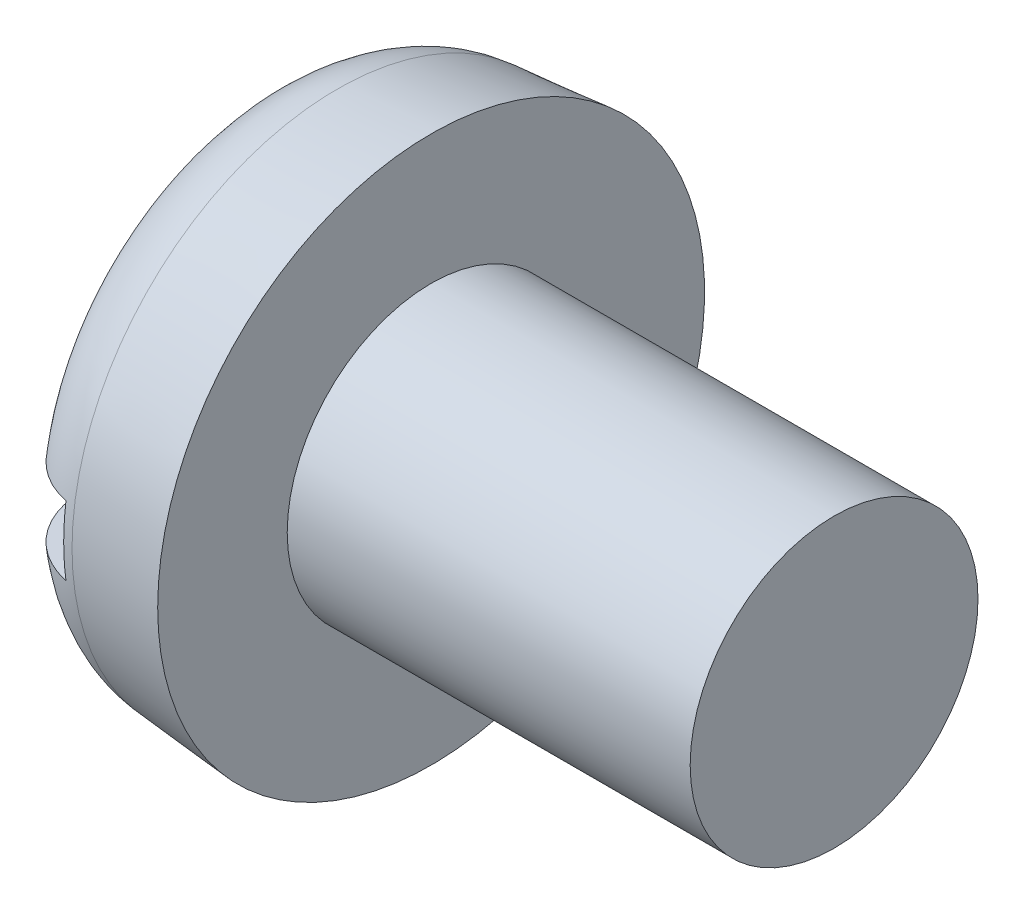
ISO-10303-21;
HEADER;
FILE_DESCRIPTION(('STEP AP214'),'2;1');
FILE_NAME('part.step','',(''),(''),'','','');
FILE_SCHEMA(('AUTOMOTIVE_DESIGN { 1 0 10303 214 1 1 1 1 }'));
ENDSEC;
DATA;
#1=APPLICATION_CONTEXT('core data for automotive mechanical design processes');
#2=APPLICATION_PROTOCOL_DEFINITION('international standard','automotive_design',2000,#1);
#3=PRODUCT_CONTEXT('',#1,'mechanical');
#4=PRODUCT('Part','Part','',(#3));
#5=PRODUCT_RELATED_PRODUCT_CATEGORY('part','',(#4));
#6=PRODUCT_DEFINITION_FORMATION('','',#4);
#7=PRODUCT_DEFINITION_CONTEXT('part definition',#1,'design');
#8=PRODUCT_DEFINITION('design','',#6,#7);
#9=PRODUCT_DEFINITION_SHAPE('','',#8);
#10=(LENGTH_UNIT() NAMED_UNIT(*) SI_UNIT(.MILLI.,.METRE.));
#11=(NAMED_UNIT(*) PLANE_ANGLE_UNIT() SI_UNIT($,.RADIAN.));
#12=(NAMED_UNIT(*) SI_UNIT($,.STERADIAN.) SOLID_ANGLE_UNIT());
#13=UNCERTAINTY_MEASURE_WITH_UNIT(LENGTH_MEASURE(1.E-05),#10,'distance_accuracy_value','');
#14=(GEOMETRIC_REPRESENTATION_CONTEXT(3) GLOBAL_UNCERTAINTY_ASSIGNED_CONTEXT((#13)) GLOBAL_UNIT_ASSIGNED_CONTEXT((#10,
#11,#12)) REPRESENTATION_CONTEXT('',''));
#15=CARTESIAN_POINT('',(0.,0.,0.));
#16=DIRECTION('',(0.,0.,1.));
#17=DIRECTION('',(1.,0.,0.));
#18=AXIS2_PLACEMENT_3D('',#15,#16,#17);
#19=CARTESIAN_POINT('',(0.,0.,0.));
#20=DIRECTION('',(-1.,0.,0.));
#21=DIRECTION('',(0.,0.,1.));
#22=AXIS2_PLACEMENT_3D('',#19,#20,#21);
#23=PLANE('',#22);
#24=DIRECTION('',(0.,0.,-1.));
#25=VECTOR('',#24,1.);
#26=CARTESIAN_POINT('',(0.,0.599999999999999,4.75));
#27=LINE('',#26,#25);
#28=CARTESIAN_POINT('',(0.,0.599999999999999,3.05466870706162));
#29=VERTEX_POINT('',#28);
#30=CARTESIAN_POINT('',(0.,0.599999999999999,-3.05466870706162));
#31=VERTEX_POINT('',#30);
#32=EDGE_CURVE('E86',#29,#31,#27,.T.);
#33=ORIENTED_EDGE('',*,*,#32,.F.);
#34=CARTESIAN_POINT('',(0.,0.,0.));
#35=DIRECTION('',(-1.,0.,0.));
#36=DIRECTION('',(0.,0.,1.));
#37=AXIS2_PLACEMENT_3D('',#34,#35,#36);
#38=CIRCLE('',#37,3.11303724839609);
#39=EDGE_CURVE('E92',#29,#31,#38,.T.);
#40=ORIENTED_EDGE('',*,*,#39,.T.);
#41=EDGE_LOOP('',(#33,#40));
#42=FACE_BOUND('',#41,.T.);
#43=ADVANCED_FACE('F33',(#42),#23,.T.);
#44=CARTESIAN_POINT('',(-25.4,0.,0.));
#45=DIRECTION('',(-1.,0.,0.));
#46=DIRECTION('',(0.,0.,1.));
#47=AXIS2_PLACEMENT_3D('',#44,#45,#46);
#48=CYLINDRICAL_SURFACE('',#47,2.5);
#49=CARTESIAN_POINT('',(10.,0.,0.));
#50=DIRECTION('',(-1.,0.,0.));
#51=DIRECTION('',(0.,0.,1.));
#52=AXIS2_PLACEMENT_3D('',#49,#50,#51);
#53=CIRCLE('',#52,2.5);
#54=CARTESIAN_POINT('',(10.,0.,2.5));
#55=VERTEX_POINT('',#54);
#56=EDGE_CURVE('E93',#55,#55,#53,.T.);
#57=ORIENTED_EDGE('',*,*,#56,.T.);
#58=EDGE_LOOP('',(#57));
#59=FACE_BOUND('',#58,.T.);
#60=CARTESIAN_POINT('',(3.,0.,0.));
#61=DIRECTION('',(-1.,0.,0.));
#62=DIRECTION('',(0.,0.,1.));
#63=AXIS2_PLACEMENT_3D('',#60,#61,#62);
#64=CIRCLE('',#63,2.5);
#65=CARTESIAN_POINT('',(3.,0.,2.5));
#66=VERTEX_POINT('',#65);
#67=EDGE_CURVE('E150',#66,#66,#64,.T.);
#68=ORIENTED_EDGE('',*,*,#67,.F.);
#69=EDGE_LOOP('',(#68));
#70=FACE_BOUND('',#69,.T.);
#71=ADVANCED_FACE('F138',(#59,#70),#48,.T.);
#72=CARTESIAN_POINT('',(10.,2.5,0.));
#73=DIRECTION('',(1.,0.,0.));
#74=DIRECTION('',(0.,0.,-1.));
#75=AXIS2_PLACEMENT_3D('',#72,#73,#74);
#76=PLANE('',#75);
#77=ORIENTED_EDGE('',*,*,#56,.F.);
#78=EDGE_LOOP('',(#77));
#79=FACE_BOUND('',#78,.T.);
#80=ADVANCED_FACE('F136',(#79),#76,.T.);
#81=DIRECTION('',(0.,0.,1.));
#82=VECTOR('',#81,1.);
#83=CARTESIAN_POINT('',(0.,-0.599999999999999,-4.75));
#84=LINE('',#83,#82);
#85=CARTESIAN_POINT('',(0.,-0.599999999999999,-3.05466870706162));
#86=VERTEX_POINT('',#85);
#87=CARTESIAN_POINT('',(0.,-0.6,3.05466870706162));
#88=VERTEX_POINT('',#87);
#89=EDGE_CURVE('E77',#86,#88,#84,.T.);
#90=ORIENTED_EDGE('',*,*,#89,.F.);
#91=EDGE_CURVE('E84',#86,#88,#38,.T.);
#92=ORIENTED_EDGE('',*,*,#91,.T.);
#93=EDGE_LOOP('',(#90,#92));
#94=FACE_BOUND('',#93,.T.);
#95=ADVANCED_FACE('F83',(#94),#23,.T.);
#96=CARTESIAN_POINT('',(0.,0.,0.));
#97=DIRECTION('',(1.,0.,0.));
#98=DIRECTION('',(0.,0.,-1.));
#99=AXIS2_PLACEMENT_3D('',#96,#97,#98);
#100=CONICAL_SURFACE('',#99,4.48753400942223,0.0872664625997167);
#101=CARTESIAN_POINT('',(1.36926638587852,0.,0.));
#102=DIRECTION('',(-1.,0.,0.));
#103=DIRECTION('',(0.,0.,1.));
#104=AXIS2_PLACEMENT_3D('',#101,#102,#103);
#105=CIRCLE('',#104,4.60732929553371);
#106=CARTESIAN_POINT('',(1.36926638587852,0.,4.60732929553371));
#107=VERTEX_POINT('',#106);
#108=EDGE_CURVE('E96',#107,#107,#105,.F.);
#109=ORIENTED_EDGE('',*,*,#108,.T.);
#110=EDGE_LOOP('',(#109));
#111=FACE_BOUND('',#110,.T.);
#112=CARTESIAN_POINT('',(3.,0.,0.));
#113=DIRECTION('',(-1.,0.,0.));
#114=DIRECTION('',(0.,0.,1.));
#115=AXIS2_PLACEMENT_3D('',#112,#113,#114);
#116=CIRCLE('',#115,4.75);
#117=CARTESIAN_POINT('',(3.,0.,4.75));
#118=VERTEX_POINT('',#117);
#119=EDGE_CURVE('E98',#118,#118,#116,.T.);
#120=ORIENTED_EDGE('',*,*,#119,.T.);
#121=EDGE_LOOP('',(#120));
#122=FACE_BOUND('',#121,.T.);
#123=ADVANCED_FACE('F129',(#111,#122),#100,.T.);
#124=CARTESIAN_POINT('',(3.,2.5,0.));
#125=DIRECTION('',(-1.,0.,0.));
#126=DIRECTION('',(0.,0.,1.));
#127=AXIS2_PLACEMENT_3D('',#124,#125,#126);
#128=PLANE('',#127);
#129=ORIENTED_EDGE('',*,*,#119,.F.);
#130=EDGE_LOOP('',(#129));
#131=FACE_BOUND('',#130,.T.);
#132=ORIENTED_EDGE('',*,*,#67,.T.);
#133=EDGE_LOOP('',(#132));
#134=FACE_BOUND('',#133,.T.);
#135=ADVANCED_FACE('F125',(#131,#134),#128,.F.);
#136=CARTESIAN_POINT('',(1.5,0.,0.));
#137=DIRECTION('',(-1.,0.,0.));
#138=DIRECTION('',(0.,0.,1.));
#139=AXIS2_PLACEMENT_3D('',#136,#137,#138);
#140=TOROIDAL_SURFACE('',#139,3.11303724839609,1.5);
#141=CARTESIAN_POINT('',(0.474243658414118,0.599999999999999,-4.16448807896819));
#142=CARTESIAN_POINT('',(0.535197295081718,0.599999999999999,-4.2222007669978));
#143=CARTESIAN_POINT('',(0.601040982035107,0.599999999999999,-4.27483380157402));
#144=CARTESIAN_POINT('',(0.740675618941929,0.599999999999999,-4.36835495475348));
#145=CARTESIAN_POINT('',(0.814475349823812,0.599999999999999,-4.40922990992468));
#146=CARTESIAN_POINT('',(0.967890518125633,0.599999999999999,-4.47797693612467));
#147=CARTESIAN_POINT('',(1.04750461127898,0.599999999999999,-4.50585200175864));
#148=CARTESIAN_POINT('',(1.21027286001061,0.599999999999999,-4.54777716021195));
#149=CARTESIAN_POINT('',(1.29342617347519,0.599999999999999,-4.56183052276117));
#150=CARTESIAN_POINT('',(1.46061786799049,0.599999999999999,-4.57568541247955));
#151=CARTESIAN_POINT('',(1.54465212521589,0.599999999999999,-4.57553672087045));
#152=CARTESIAN_POINT('',(1.71150157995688,0.599999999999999,-4.56111544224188));
#153=CARTESIAN_POINT('',(1.79431675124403,0.599999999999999,-4.546842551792));
#154=CARTESIAN_POINT('',(1.95628107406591,0.599999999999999,-4.50461633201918));
#155=CARTESIAN_POINT('',(2.03543426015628,0.599999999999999,-4.47667847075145));
#156=CARTESIAN_POINT('',(2.18794473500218,0.599999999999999,-4.40794662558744));
#157=CARTESIAN_POINT('',(2.26130200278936,0.599999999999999,-4.36715259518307));
#158=CARTESIAN_POINT('',(2.40037319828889,0.599999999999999,-4.27376142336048));
#159=CARTESIAN_POINT('',(2.46606492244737,0.599999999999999,-4.22113122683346));
#160=CARTESIAN_POINT('',(2.58775416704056,0.599999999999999,-4.10565865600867));
#161=CARTESIAN_POINT('',(2.64375146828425,0.599999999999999,-4.04281605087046));
#162=CARTESIAN_POINT('',(2.7448997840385,0.599999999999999,-3.90824759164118));
#163=CARTESIAN_POINT('',(2.78997229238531,0.599999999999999,-3.83646274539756));
#164=CARTESIAN_POINT('',(2.86758143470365,0.599999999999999,-3.6864129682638));
#165=CARTESIAN_POINT('',(2.90011748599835,0.599999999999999,-3.60814773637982));
#166=CARTESIAN_POINT('',(2.95215516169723,0.599999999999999,-3.44640006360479));
#167=CARTESIAN_POINT('',(2.9715017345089,0.599999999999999,-3.36286776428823));
#168=CARTESIAN_POINT('',(2.99613620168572,0.599999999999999,-3.19375865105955));
#169=CARTESIAN_POINT('',(3.00142305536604,0.599999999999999,-3.10818168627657));
#170=CARTESIAN_POINT('',(2.9978948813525,0.599999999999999,-2.93593785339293));
#171=CARTESIAN_POINT('',(2.98885075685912,0.599999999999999,-2.84927570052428));
#172=CARTESIAN_POINT('',(2.95661294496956,0.599999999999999,-2.67862588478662));
#173=CARTESIAN_POINT('',(2.93341783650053,0.599999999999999,-2.59463849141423));
#174=CARTESIAN_POINT('',(2.87305940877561,0.599999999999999,-2.43009011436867));
#175=CARTESIAN_POINT('',(2.8356478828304,0.599999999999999,-2.3496201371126));
#176=CARTESIAN_POINT('',(2.74798933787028,0.599999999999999,-2.1959917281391));
#177=CARTESIAN_POINT('',(2.69774036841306,0.599999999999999,-2.12283440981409));
#178=CARTESIAN_POINT('',(2.58515210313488,0.599999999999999,-1.98517825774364));
#179=CARTESIAN_POINT('',(2.52268993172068,0.599999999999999,-1.92077976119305));
#180=CARTESIAN_POINT('',(2.3876474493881,0.599999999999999,-1.80360821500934));
#181=CARTESIAN_POINT('',(2.31506700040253,0.599999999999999,-1.75083532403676));
#182=CARTESIAN_POINT('',(2.16324197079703,0.599999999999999,-1.65981326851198));
#183=CARTESIAN_POINT('',(2.08415844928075,0.599999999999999,-1.62129637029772));
#184=CARTESIAN_POINT('',(1.92036681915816,0.599999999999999,-1.55909823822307));
#185=CARTESIAN_POINT('',(1.83566227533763,0.599999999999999,-1.53540769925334));
#186=CARTESIAN_POINT('',(1.66868507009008,0.599999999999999,-1.50512561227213));
#187=CARTESIAN_POINT('',(1.58658829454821,0.599999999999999,-1.4975631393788));
#188=CARTESIAN_POINT('',(1.42235866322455,0.599999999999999,-1.49703912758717));
#189=CARTESIAN_POINT('',(1.34022582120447,0.599999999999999,-1.50407401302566));
#190=CARTESIAN_POINT('',(1.18200056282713,0.599999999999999,-1.53172166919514));
#191=CARTESIAN_POINT('',(1.10580089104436,0.599999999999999,-1.55172937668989));
#192=CARTESIAN_POINT('',(0.957649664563,0.599999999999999,-1.60381093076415));
#193=CARTESIAN_POINT('',(0.885698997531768,0.599999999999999,-1.63588728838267));
#194=CARTESIAN_POINT('',(0.745245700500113,0.599999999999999,-1.71223681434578));
#195=CARTESIAN_POINT('',(0.676958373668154,0.599999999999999,-1.75690511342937));
#196=CARTESIAN_POINT('',(0.548253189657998,0.599999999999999,-1.85641398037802));
#197=CARTESIAN_POINT('',(0.487837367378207,0.599999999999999,-1.91125716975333));
#198=CARTESIAN_POINT('',(0.372604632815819,0.599999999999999,-2.0333995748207));
#199=CARTESIAN_POINT('',(0.318393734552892,0.599999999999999,-2.10127142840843));
#200=CARTESIAN_POINT('',(0.22172170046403,0.599999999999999,-2.24492747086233));
#201=CARTESIAN_POINT('',(0.179262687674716,0.599999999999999,-2.32071308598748));
#202=CARTESIAN_POINT('',(0.106126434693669,0.599999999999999,-2.48060945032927));
#203=CARTESIAN_POINT('',(0.0758504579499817,0.599999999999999,-2.56490423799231));
#204=CARTESIAN_POINT('',(0.0299480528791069,0.599999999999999,-2.737393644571));
#205=CARTESIAN_POINT('',(0.0143211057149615,0.599999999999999,-2.82558812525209));
#206=CARTESIAN_POINT('',(-0.00166405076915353,0.599999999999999,-3.00295249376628));
#207=CARTESIAN_POINT('',(-0.0020913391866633,0.599999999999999,-3.09211612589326));
#208=CARTESIAN_POINT('',(0.012315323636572,0.599999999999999,-3.26923006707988));
#209=CARTESIAN_POINT('',(0.0271518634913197,0.599999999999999,-3.35718016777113));
#210=CARTESIAN_POINT('',(0.0713942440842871,0.599999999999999,-3.52770551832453));
#211=CARTESIAN_POINT('',(0.100543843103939,0.599999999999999,-3.61034739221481));
#212=CARTESIAN_POINT('',(0.172532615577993,0.599999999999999,-3.7693538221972));
#213=CARTESIAN_POINT('',(0.215353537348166,0.599999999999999,-3.84572657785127));
#214=CARTESIAN_POINT('',(0.294810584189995,0.599999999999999,-3.9625299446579));
#215=CARTESIAN_POINT('',(0.327631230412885,0.599999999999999,-4.00560511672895));
#216=CARTESIAN_POINT('',(0.397705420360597,0.599999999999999,-4.08798619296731));
#217=CARTESIAN_POINT('',(0.434958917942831,0.599999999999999,-4.12729213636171));
#218=CARTESIAN_POINT('',(0.474243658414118,0.599999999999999,-4.16448807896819));
#219=B_SPLINE_CURVE_WITH_KNOTS('',3,(#141,#142,#143,#144,#145,#146,#147,#148,#149,#150,#151,
#152,#153,#154,#155,#156,#157,#158,#159,#160,#161,#162,#163,#164,#165,#166,#167,#168,#169,#170,
#171,#172,#173,#174,#175,#176,#177,#178,#179,#180,#181,#182,#183,#184,#185,#186,#187,#188,#189,
#190,#191,#192,#193,#194,#195,#196,#197,#198,#199,#200,#201,#202,#203,#204,#205,#206,#207,#208,
#209,#210,#211,#212,#213,#214,#215,#216,#217,#218),.UNSPECIFIED.,.T.,.F.,(4,2,2,2,2,2,2,2,2,2,2,
2,2,2,2,2,2,2,2,2,2,2,2,2,2,2,2,2,2,2,2,2,2,2,2,2,2,2,4),(0.,0.251627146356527,
0.503534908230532,0.755384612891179,1.00717472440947,1.25808229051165,1.50899524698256,
1.75962483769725,2.01025533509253,2.26159466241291,2.5129396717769,2.76604060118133,
3.01915329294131,3.27519243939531,3.53125053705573,3.79144347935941,4.05166255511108,
4.31665070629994,4.58167914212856,4.84952563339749,5.1173757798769,5.37990411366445,
5.64226751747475,5.88833003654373,6.13433228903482,6.36961414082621,6.60494497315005,
6.84869102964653,7.09249997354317,7.35191672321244,7.61138030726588,7.87880123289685,
8.14621268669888,8.41240865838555,8.67864978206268,8.94028930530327,9.20158098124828,
9.36375686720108,9.52593106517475),.UNSPECIFIED.);
#220=CARTESIAN_POINT('',(1.2,0.599999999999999,-4.54328342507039));
#221=VERTEX_POINT('',#220);
#222=EDGE_CURVE('E11',#31,#221,#219,.T.);
#223=ORIENTED_EDGE('',*,*,#222,.F.);
#224=ORIENTED_EDGE('',*,*,#39,.F.);
#225=CARTESIAN_POINT('',(0.642058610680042,0.599999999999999,1.78444467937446));
#226=CARTESIAN_POINT('',(0.708203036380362,0.599999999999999,1.73578880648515));
#227=CARTESIAN_POINT('',(0.778279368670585,0.599999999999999,1.69241067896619));
#228=CARTESIAN_POINT('',(0.924661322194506,0.599999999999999,1.61775076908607));
#229=CARTESIAN_POINT('',(1.00097010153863,0.599999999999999,1.58647516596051));
#230=CARTESIAN_POINT('',(1.15801751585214,0.599999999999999,1.537335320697));
#231=CARTESIAN_POINT('',(1.23876602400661,0.599999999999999,1.51950238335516));
#232=CARTESIAN_POINT('',(1.40212199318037,0.599999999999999,1.49831173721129));
#233=CARTESIAN_POINT('',(1.48472861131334,0.599999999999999,1.49494759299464));
#234=CARTESIAN_POINT('',(1.64595983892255,0.599999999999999,1.50270631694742));
#235=CARTESIAN_POINT('',(1.72461257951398,0.599999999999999,1.51326068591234));
#236=CARTESIAN_POINT('',(1.8790539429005,0.599999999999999,1.54733501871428));
#237=CARTESIAN_POINT('',(1.95484205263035,0.599999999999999,1.57085729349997));
#238=CARTESIAN_POINT('',(2.10217401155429,0.599999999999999,1.63005609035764));
#239=CARTESIAN_POINT('',(2.17368023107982,0.599999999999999,1.6658257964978));
#240=CARTESIAN_POINT('',(2.310172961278,0.599999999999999,1.74815983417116));
#241=CARTESIAN_POINT('',(2.37515789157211,0.599999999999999,1.79472677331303));
#242=CARTESIAN_POINT('',(2.50111037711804,0.599999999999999,1.90052230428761));
#243=CARTESIAN_POINT('',(2.56156048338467,0.599999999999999,1.96036731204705));
#244=CARTESIAN_POINT('',(2.67210720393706,0.599999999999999,2.08896077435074));
#245=CARTESIAN_POINT('',(2.72220143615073,0.599999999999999,2.15771127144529));
#246=CARTESIAN_POINT('',(2.81284735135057,0.599999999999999,2.30563751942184));
#247=CARTESIAN_POINT('',(2.85285618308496,0.599999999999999,2.38514674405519));
#248=CARTESIAN_POINT('',(2.91905433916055,0.599999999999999,2.54972911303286));
#249=CARTESIAN_POINT('',(2.94524280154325,0.599999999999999,2.63480260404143));
#250=CARTESIAN_POINT('',(2.98307112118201,0.599999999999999,2.80866920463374));
#251=CARTESIAN_POINT('',(2.9946229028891,0.599999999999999,2.89748154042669));
#252=CARTESIAN_POINT('',(3.00240662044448,0.599999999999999,3.07577878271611));
#253=CARTESIAN_POINT('',(2.998639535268,0.599999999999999,3.16526364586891));
#254=CARTESIAN_POINT('',(2.97592433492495,0.599999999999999,3.34090743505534));
#255=CARTESIAN_POINT('',(2.95720740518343,0.599999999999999,3.42709622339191));
#256=CARTESIAN_POINT('',(2.90529569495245,0.599999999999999,3.59499998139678));
#257=CARTESIAN_POINT('',(2.87210231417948,0.599999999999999,3.67671538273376));
#258=CARTESIAN_POINT('',(2.7928517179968,0.599999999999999,3.83175947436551));
#259=CARTESIAN_POINT('',(2.7470416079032,0.599999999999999,3.90521449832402));
#260=CARTESIAN_POINT('',(2.64356788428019,0.599999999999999,4.04323981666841));
#261=CARTESIAN_POINT('',(2.58590525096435,0.599999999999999,4.10781084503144));
#262=CARTESIAN_POINT('',(2.46128327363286,0.599999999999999,4.22525214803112));
#263=CARTESIAN_POINT('',(2.39447165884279,0.599999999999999,4.27827922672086));
#264=CARTESIAN_POINT('',(2.25282231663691,0.599999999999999,4.37223374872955));
#265=CARTESIAN_POINT('',(2.17798504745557,0.599999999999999,4.41316188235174));
#266=CARTESIAN_POINT('',(2.02319107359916,0.599999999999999,4.48136089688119));
#267=CARTESIAN_POINT('',(1.94329070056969,0.599999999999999,4.50875968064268));
#268=CARTESIAN_POINT('',(1.78001182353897,0.599999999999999,4.54967680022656));
#269=CARTESIAN_POINT('',(1.69663343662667,0.599999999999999,4.5631956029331));
#270=CARTESIAN_POINT('',(1.52922201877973,0.599999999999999,4.57591948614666));
#271=CARTESIAN_POINT('',(1.44519451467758,0.599999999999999,4.57519739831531));
#272=CARTESIAN_POINT('',(1.27845728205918,0.599999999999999,4.55963992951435));
#273=CARTESIAN_POINT('',(1.19574753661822,0.599999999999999,4.54480472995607));
#274=CARTESIAN_POINT('',(1.0340786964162,0.599999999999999,4.50147996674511));
#275=CARTESIAN_POINT('',(0.95511580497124,0.599999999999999,4.47300456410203));
#276=CARTESIAN_POINT('',(0.803072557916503,0.599999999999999,4.40323812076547));
#277=CARTESIAN_POINT('',(0.729992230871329,0.599999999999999,4.36194701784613));
#278=CARTESIAN_POINT('',(0.59154832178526,0.599999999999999,4.26761123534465));
#279=CARTESIAN_POINT('',(0.526207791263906,0.599999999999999,4.21453273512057));
#280=CARTESIAN_POINT('',(0.405289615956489,0.599999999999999,4.09822911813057));
#281=CARTESIAN_POINT('',(0.349712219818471,0.599999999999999,4.03500374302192));
#282=CARTESIAN_POINT('',(0.249458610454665,0.599999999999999,3.89973755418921));
#283=CARTESIAN_POINT('',(0.204862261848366,0.599999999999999,3.82763756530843));
#284=CARTESIAN_POINT('',(0.128249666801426,0.599999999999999,3.67704118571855));
#285=CARTESIAN_POINT('',(0.0962340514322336,0.599999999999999,3.59854447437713));
#286=CARTESIAN_POINT('',(0.0452695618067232,0.599999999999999,3.43641182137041));
#287=CARTESIAN_POINT('',(0.0264776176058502,0.599999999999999,3.35272657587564));
#288=CARTESIAN_POINT('',(0.00296961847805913,0.599999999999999,3.18340853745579));
#289=CARTESIAN_POINT('',(-0.00174593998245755,0.599999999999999,3.09777567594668));
#290=CARTESIAN_POINT('',(0.00293340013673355,0.599999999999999,2.92551527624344));
#291=CARTESIAN_POINT('',(0.0125572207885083,0.599999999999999,2.83889398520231));
#292=CARTESIAN_POINT('',(0.045943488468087,0.599999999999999,2.66839997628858));
#293=CARTESIAN_POINT('',(0.0697105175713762,0.599999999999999,2.58452815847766));
#294=CARTESIAN_POINT('',(0.131206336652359,0.599999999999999,2.42028022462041));
#295=CARTESIAN_POINT('',(0.169188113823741,0.599999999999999,2.3399989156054));
#296=CARTESIAN_POINT('',(0.257932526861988,0.599999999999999,2.18690708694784));
#297=CARTESIAN_POINT('',(0.308683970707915,0.599999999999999,2.11409010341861));
#298=CARTESIAN_POINT('',(0.405756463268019,0.599999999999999,1.9970345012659));
#299=CARTESIAN_POINT('',(0.449343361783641,0.599999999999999,1.9505006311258));
#300=CARTESIAN_POINT('',(0.54185180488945,0.599999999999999,1.86306846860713));
#301=CARTESIAN_POINT('',(0.590773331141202,0.599999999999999,1.82217015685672));
#302=CARTESIAN_POINT('',(0.642058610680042,0.599999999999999,1.78444467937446));
#303=B_SPLINE_CURVE_WITH_KNOTS('',3,(#225,#226,#227,#228,#229,#230,#231,#232,#233,#234,#235,
#236,#237,#238,#239,#240,#241,#242,#243,#244,#245,#246,#247,#248,#249,#250,#251,#252,#253,#254,
#255,#256,#257,#258,#259,#260,#261,#262,#263,#264,#265,#266,#267,#268,#269,#270,#271,#272,#273,
#274,#275,#276,#277,#278,#279,#280,#281,#282,#283,#284,#285,#286,#287,#288,#289,#290,#291,#292,
#293,#294,#295,#296,#297,#298,#299,#300,#301,#302),.UNSPECIFIED.,.T.,.F.,(4,2,2,2,2,2,2,2,2,2,2,
2,2,2,2,2,2,2,2,2,2,2,2,2,2,2,2,2,2,2,2,2,2,2,2,2,2,2,4),(0.,0.24612605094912,0.492377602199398,
0.739200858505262,0.985914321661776,1.22285638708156,1.45984069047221,1.69866969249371,
1.93755643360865,2.19161852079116,2.4457389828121,2.7115111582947,2.97729990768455,
3.24468054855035,3.51204410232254,3.77535136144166,4.03863316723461,4.29708605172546,
4.55551757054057,4.81018291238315,5.06483372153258,5.31702870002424,5.56921519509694,
5.82011227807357,6.07100613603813,6.32164008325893,6.57227524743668,6.8236390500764,
7.07500925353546,7.32815697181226,7.58131738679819,7.83743366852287,8.09355898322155,
8.35381727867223,8.61415993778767,8.87937525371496,9.14435892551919,9.33519415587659,
9.52602873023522),.UNSPECIFIED.);
#304=CARTESIAN_POINT('',(1.2,0.599999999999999,4.54328342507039));
#305=VERTEX_POINT('',#304);
#306=EDGE_CURVE('E110',#305,#29,#303,.T.);
#307=ORIENTED_EDGE('',*,*,#306,.F.);
#308=CARTESIAN_POINT('',(1.2,0.,0.));
#309=DIRECTION('',(-1.,0.,0.));
#310=DIRECTION('',(0.,0.,1.));
#311=AXIS2_PLACEMENT_3D('',#308,#309,#310);
#312=CIRCLE('',#311,4.582731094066);
#313=CARTESIAN_POINT('',(1.2,-0.6,4.54328342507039));
#314=VERTEX_POINT('',#313);
#315=EDGE_CURVE('E104',#305,#314,#312,.F.);
#316=ORIENTED_EDGE('',*,*,#315,.T.);
#317=CARTESIAN_POINT('',(0.642058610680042,-0.6,1.78444467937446));
#318=CARTESIAN_POINT('',(0.570752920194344,-0.6,1.83690352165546));
#319=CARTESIAN_POINT('',(0.503916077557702,-0.6,1.89557553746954));
#320=CARTESIAN_POINT('',(0.380973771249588,-0.6,2.02337981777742));
#321=CARTESIAN_POINT('',(0.324888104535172,-0.6,2.09253096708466));
#322=CARTESIAN_POINT('',(0.225075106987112,-0.6,2.23912059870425));
#323=CARTESIAN_POINT('',(0.181331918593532,-0.6,2.31654826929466));
#324=CARTESIAN_POINT('',(0.10735821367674,-0.6,2.4775679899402));
#325=CARTESIAN_POINT('',(0.0771217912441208,-0.6,2.56115732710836));
#326=CARTESIAN_POINT('',(0.0308710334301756,-0.6,2.732939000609));
#327=CARTESIAN_POINT('',(0.0149771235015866,-0.6,2.82116384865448));
#328=CARTESIAN_POINT('',(-0.0015567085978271,-0.6,2.99904386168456));
#329=CARTESIAN_POINT('',(-0.00219606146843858,-0.6,3.08869907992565));
#330=CARTESIAN_POINT('',(0.0118531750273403,-0.6,3.26558059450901));
#331=CARTESIAN_POINT('',(0.0263341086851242,-0.6,3.35282334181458));
#332=CARTESIAN_POINT('',(0.0700194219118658,-0.6,3.52354291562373));
#333=CARTESIAN_POINT('',(0.099222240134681,-0.6,3.60702014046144));
#334=CARTESIAN_POINT('',(0.170926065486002,-0.6,3.76619303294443));
#335=CARTESIAN_POINT('',(0.213170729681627,-0.6,3.84200419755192));
#336=CARTESIAN_POINT('',(0.309975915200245,-0.6,3.98530836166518));
#337=CARTESIAN_POINT('',(0.364535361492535,-0.6,4.05280208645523));
#338=CARTESIAN_POINT('',(0.483508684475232,-0.6,4.1764763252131));
#339=CARTESIAN_POINT('',(0.5477595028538,-0.6,4.23281374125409));
#340=CARTESIAN_POINT('',(0.684891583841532,-0.6,4.33376627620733));
#341=CARTESIAN_POINT('',(0.757772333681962,-0.6,4.37838209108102));
#342=CARTESIAN_POINT('',(0.909277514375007,-0.6,4.45415785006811));
#343=CARTESIAN_POINT('',(0.98783477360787,-0.6,4.4854521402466));
#344=CARTESIAN_POINT('',(1.14910626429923,-0.6,4.53432193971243));
#345=CARTESIAN_POINT('',(1.23182034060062,-0.6,4.55189796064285));
#346=CARTESIAN_POINT('',(1.39854874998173,-0.6,4.57274942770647));
#347=CARTESIAN_POINT('',(1.48255291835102,-0.6,4.57610622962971));
#348=CARTESIAN_POINT('',(1.64992840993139,-0.6,4.56864397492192));
#349=CARTESIAN_POINT('',(1.73329974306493,-0.6,4.55782514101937));
#350=CARTESIAN_POINT('',(1.89690556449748,-0.6,4.5223590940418));
#351=CARTESIAN_POINT('',(1.97714487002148,-0.6,4.49773409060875));
#352=CARTESIAN_POINT('',(2.13236381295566,-0.6,4.43539277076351));
#353=CARTESIAN_POINT('',(2.20734343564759,-0.6,4.39767641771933));
#354=CARTESIAN_POINT('',(2.35011399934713,-0.6,4.31014761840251));
#355=CARTESIAN_POINT('',(2.41788774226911,-0.6,4.26030712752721));
#356=CARTESIAN_POINT('',(2.54417141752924,-0.6,4.15002218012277));
#357=CARTESIAN_POINT('',(2.60268114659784,-0.6,4.08957749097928));
#358=CARTESIAN_POINT('',(2.70919785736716,-0.6,3.9593981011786));
#359=CARTESIAN_POINT('',(2.75713464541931,-0.6,3.88960598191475));
#360=CARTESIAN_POINT('',(2.84075534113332,-0.6,3.74303514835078));
#361=CARTESIAN_POINT('',(2.8764387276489,-0.6,3.66625613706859));
#362=CARTESIAN_POINT('',(2.93498131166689,-0.6,3.50699921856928));
#363=CARTESIAN_POINT('',(2.95769541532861,-0.6,3.42446799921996));
#364=CARTESIAN_POINT('',(2.98917609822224,-0.6,3.25679047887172));
#365=CARTESIAN_POINT('',(2.99794169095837,-0.6,3.17164399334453));
#366=CARTESIAN_POINT('',(3.00144063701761,-0.6,2.99973325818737));
#367=CARTESIAN_POINT('',(2.99595250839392,-0.6,2.91296452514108));
#368=CARTESIAN_POINT('',(2.97076041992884,-0.6,2.74151789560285));
#369=CARTESIAN_POINT('',(2.95105508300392,-0.6,2.6568402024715));
#370=CARTESIAN_POINT('',(2.8975856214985,-0.6,2.49032583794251));
#371=CARTESIAN_POINT('',(2.86356984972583,-0.6,2.40856994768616));
#372=CARTESIAN_POINT('',(2.78246737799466,-0.6,2.25181146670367));
#373=CARTESIAN_POINT('',(2.73537879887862,-0.6,2.17680984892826));
#374=CARTESIAN_POINT('',(2.6287380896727,-0.6,2.03476656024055));
#375=CARTESIAN_POINT('',(2.56903700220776,-0.6,1.96783656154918));
#376=CARTESIAN_POINT('',(2.43909597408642,-0.6,1.84509773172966));
#377=CARTESIAN_POINT('',(2.36885525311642,-0.6,1.7892897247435));
#378=CARTESIAN_POINT('',(2.22077231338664,-0.6,1.6915159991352));
#379=CARTESIAN_POINT('',(2.14305625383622,-0.6,1.64935982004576));
#380=CARTESIAN_POINT('',(1.98134627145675,-0.6,1.57962775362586));
#381=CARTESIAN_POINT('',(1.89735630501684,-0.6,1.55204276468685));
#382=CARTESIAN_POINT('',(1.73074700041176,-0.6,1.51405337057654));
#383=CARTESIAN_POINT('',(1.64833577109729,-0.6,1.50273689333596));
#384=CARTESIAN_POINT('',(1.48280159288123,-0.6,1.49493998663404));
#385=CARTESIAN_POINT('',(1.39967868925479,-0.6,1.49845862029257));
#386=CARTESIAN_POINT('',(1.23954957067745,-0.6,1.5195684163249));
#387=CARTESIAN_POINT('',(1.16244637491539,-0.6,1.53644040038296));
#388=CARTESIAN_POINT('',(1.01210690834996,-0.6,1.58254863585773));
#389=CARTESIAN_POINT('',(0.938866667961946,-0.6,1.61177190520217));
#390=CARTESIAN_POINT('',(0.828774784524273,-0.6,1.66615585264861));
#391=CARTESIAN_POINT('',(0.789995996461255,-0.6,1.68752043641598));
#392=CARTESIAN_POINT('',(0.714458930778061,-0.6,1.73355428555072));
#393=CARTESIAN_POINT('',(0.677700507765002,-0.6,1.75822331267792));
#394=CARTESIAN_POINT('',(0.642058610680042,-0.6,1.78444467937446));
#395=B_SPLINE_CURVE_WITH_KNOTS('',3,(#317,#318,#319,#320,#321,#322,#323,#324,#325,#326,#327,
#328,#329,#330,#331,#332,#333,#334,#335,#336,#337,#338,#339,#340,#341,#342,#343,#344,#345,#346,
#347,#348,#349,#350,#351,#352,#353,#354,#355,#356,#357,#358,#359,#360,#361,#362,#363,#364,#365,
#366,#367,#368,#369,#370,#371,#372,#373,#374,#375,#376,#377,#378,#379,#380,#381,#382,#383,#384,
#385,#386,#387,#388,#389,#390,#391,#392,#393,#394),.UNSPECIFIED.,.T.,.F.,(4,2,2,2,2,2,2,2,2,2,2,
2,2,2,2,2,2,2,2,2,2,2,2,2,2,2,2,2,2,2,2,2,2,2,2,2,2,2,4),(0.,0.265404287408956,
0.531292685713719,0.796837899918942,1.0622668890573,1.32990433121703,1.59755176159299,
1.86157117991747,2.12556260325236,2.38466409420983,2.64374297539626,2.89886888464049,
3.15397964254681,3.40645291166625,3.65891676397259,3.90993416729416,4.16094762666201,
4.41155844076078,4.66216995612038,4.91336677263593,5.1645691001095,5.41739205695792,
5.67022576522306,5.92583525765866,6.18146282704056,6.44108615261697,6.70073462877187,
6.96515356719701,7.22961053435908,7.49738541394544,7.76518012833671,8.0290593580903,
8.2927735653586,8.54103382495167,8.78927840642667,9.02499451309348,9.2604634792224,
9.39313443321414,9.5257958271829),.UNSPECIFIED.);
#396=EDGE_CURVE('E91',#88,#314,#395,.T.);
#397=ORIENTED_EDGE('',*,*,#396,.F.);
#398=ORIENTED_EDGE('',*,*,#91,.F.);
#399=CARTESIAN_POINT('',(0.474243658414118,-0.599999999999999,-4.16448807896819));
#400=CARTESIAN_POINT('',(0.412409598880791,-0.599999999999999,-4.10593108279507));
#401=CARTESIAN_POINT('',(0.35551684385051,-0.599999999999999,-4.04205754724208));
#402=CARTESIAN_POINT('',(0.253261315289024,-0.599999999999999,-3.90557965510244));
#403=CARTESIAN_POINT('',(0.207914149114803,-0.599999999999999,-3.83296367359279));
#404=CARTESIAN_POINT('',(0.130063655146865,-0.599999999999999,-3.68123851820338));
#405=CARTESIAN_POINT('',(0.0975468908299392,-0.599999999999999,-3.6021362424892));
#406=CARTESIAN_POINT('',(0.0461131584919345,-0.599999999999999,-3.43965944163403));
#407=CARTESIAN_POINT('',(0.027192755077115,-0.599999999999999,-3.35628600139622));
#408=CARTESIAN_POINT('',(0.00320871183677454,-0.599999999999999,-3.18666752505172));
#409=CARTESIAN_POINT('',(-0.00170544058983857,-0.599999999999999,-3.10040138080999));
#410=CARTESIAN_POINT('',(0.00275015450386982,-0.599999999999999,-2.92823768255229));
#411=CARTESIAN_POINT('',(0.012121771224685,-0.599999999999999,-2.84234017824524));
#412=CARTESIAN_POINT('',(0.0450616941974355,-0.599999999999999,-2.67171740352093));
#413=CARTESIAN_POINT('',(0.0688809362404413,-0.6,-2.58704058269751));
#414=CARTESIAN_POINT('',(0.130163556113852,-0.6,-2.42277478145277));
#415=CARTESIAN_POINT('',(0.16762851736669,-0.6,-2.34318639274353));
#416=CARTESIAN_POINT('',(0.255857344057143,-0.6,-2.19000637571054));
#417=CARTESIAN_POINT('',(0.306828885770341,-0.6,-2.11653425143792));
#418=CARTESIAN_POINT('',(0.420399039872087,-0.6,-1.97917572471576));
#419=CARTESIAN_POINT('',(0.482999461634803,-0.6,-1.91529081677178));
#420=CARTESIAN_POINT('',(0.618096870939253,-0.6,-1.79922493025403));
#421=CARTESIAN_POINT('',(0.69057820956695,-0.6,-1.74702578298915));
#422=CARTESIAN_POINT('',(0.843593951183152,-0.6,-1.65617143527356));
#423=CARTESIAN_POINT('',(0.924125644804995,-0.6,-1.61751169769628));
#424=CARTESIAN_POINT('',(1.08726160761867,-0.6,-1.5568894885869));
#425=CARTESIAN_POINT('',(1.16962117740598,-0.6,-1.53427068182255));
#426=CARTESIAN_POINT('',(1.33705452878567,-0.6,-1.50426955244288));
#427=CARTESIAN_POINT('',(1.42212670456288,-0.6,-1.49687837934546));
#428=CARTESIAN_POINT('',(1.58668515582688,-0.6,-1.4977182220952));
#429=CARTESIAN_POINT('',(1.66617813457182,-0.6,-1.50497326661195));
#430=CARTESIAN_POINT('',(1.82279518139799,-0.6,-1.53279061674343));
#431=CARTESIAN_POINT('',(1.89991905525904,-0.6,-1.55335401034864));
#432=CARTESIAN_POINT('',(2.04948924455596,-0.6,-1.6067410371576));
#433=CARTESIAN_POINT('',(2.1219498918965,-0.6,-1.63952477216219));
#434=CARTESIAN_POINT('',(2.26079027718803,-0.6,-1.71610282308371));
#435=CARTESIAN_POINT('',(2.32716854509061,-0.6,-1.75989979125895));
#436=CARTESIAN_POINT('',(2.45624783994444,-0.6,-1.86010993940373));
#437=CARTESIAN_POINT('',(2.51847841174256,-0.6,-1.91712921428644));
#438=CARTESIAN_POINT('',(2.6330655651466,-0.6,-2.04035161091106));
#439=CARTESIAN_POINT('',(2.68541975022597,-0.6,-2.10655695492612));
#440=CARTESIAN_POINT('',(2.78137899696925,-0.6,-2.24995520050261));
#441=CARTESIAN_POINT('',(2.82440841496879,-0.6,-2.32753422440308));
#442=CARTESIAN_POINT('',(2.89698988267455,-0.6,-2.48876491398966));
#443=CARTESIAN_POINT('',(2.92654080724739,-0.599999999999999,-2.57241708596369));
#444=CARTESIAN_POINT('',(2.97147838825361,-0.599999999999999,-2.74436421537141));
#445=CARTESIAN_POINT('',(2.98671795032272,-0.599999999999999,-2.83269773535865));
#446=CARTESIAN_POINT('',(3.0019280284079,-0.599999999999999,-3.01067371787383));
#447=CARTESIAN_POINT('',(3.00189936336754,-0.599999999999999,-3.10031610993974));
#448=CARTESIAN_POINT('',(2.98653324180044,-0.599999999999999,-3.27703669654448));
#449=CARTESIAN_POINT('',(2.97140689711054,-0.599999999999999,-3.36413320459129));
#450=CARTESIAN_POINT('',(2.92646546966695,-0.599999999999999,-3.53445278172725));
#451=CARTESIAN_POINT('',(2.89665181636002,-0.599999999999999,-3.6176762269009));
#452=CARTESIAN_POINT('',(2.82379055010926,-0.599999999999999,-3.77624709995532));
#453=CARTESIAN_POINT('',(2.78099811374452,-0.599999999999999,-3.85171179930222));
#454=CARTESIAN_POINT('',(2.68316564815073,-0.599999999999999,-3.99423591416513));
#455=CARTESIAN_POINT('',(2.62812664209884,-0.599999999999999,-4.06129603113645));
#456=CARTESIAN_POINT('',(2.50827792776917,-0.599999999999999,-4.18404243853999));
#457=CARTESIAN_POINT('',(2.44362896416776,-0.599999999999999,-4.23988572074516));
#458=CARTESIAN_POINT('',(2.3057910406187,-0.599999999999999,-4.33979100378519));
#459=CARTESIAN_POINT('',(2.23260257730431,-0.599999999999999,-4.38385368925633));
#460=CARTESIAN_POINT('',(2.08057460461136,-0.599999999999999,-4.45849174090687));
#461=CARTESIAN_POINT('',(2.00180044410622,-0.599999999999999,-4.4892002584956));
#462=CARTESIAN_POINT('',(1.84020059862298,-0.599999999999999,-4.53687031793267));
#463=CARTESIAN_POINT('',(1.75737522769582,-0.599999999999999,-4.55383292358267));
#464=CARTESIAN_POINT('',(1.59053176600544,-0.599999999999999,-4.5734537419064));
#465=CARTESIAN_POINT('',(1.50652325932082,-0.599999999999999,-4.57619356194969));
#466=CARTESIAN_POINT('',(1.33921886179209,-0.599999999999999,-4.56750581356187));
#467=CARTESIAN_POINT('',(1.25592315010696,-0.599999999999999,-4.55607478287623));
#468=CARTESIAN_POINT('',(1.09252935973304,-0.599999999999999,-4.51940184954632));
#469=CARTESIAN_POINT('',(1.01242810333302,-0.599999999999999,-4.49417405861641));
#470=CARTESIAN_POINT('',(0.857658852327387,-0.599999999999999,-4.4306700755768));
#471=CARTESIAN_POINT('',(0.782984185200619,-0.599999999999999,-4.39241024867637));
#472=CARTESIAN_POINT('',(0.669478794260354,-0.599999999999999,-4.32168602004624));
#473=CARTESIAN_POINT('',(0.628240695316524,-0.599999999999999,-4.29300657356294));
#474=CARTESIAN_POINT('',(0.548844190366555,-0.599999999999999,-4.23166298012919));
#475=CARTESIAN_POINT('',(0.510685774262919,-0.599999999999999,-4.1989988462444));
#476=CARTESIAN_POINT('',(0.474243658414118,-0.599999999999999,-4.16448807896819));
#477=B_SPLINE_CURVE_WITH_KNOTS('',3,(#399,#400,#401,#402,#403,#404,#405,#406,#407,#408,#409,
#410,#411,#412,#413,#414,#415,#416,#417,#418,#419,#420,#421,#422,#423,#424,#425,#426,#427,#428,
#429,#430,#431,#432,#433,#434,#435,#436,#437,#438,#439,#440,#441,#442,#443,#444,#445,#446,#447,
#448,#449,#450,#451,#452,#453,#454,#455,#456,#457,#458,#459,#460,#461,#462,#463,#464,#465,#466,
#467,#468,#469,#470,#471,#472,#473,#474,#475,#476),.UNSPECIFIED.,.T.,.F.,(4,2,2,2,2,2,2,2,2,2,2,
2,2,2,2,2,2,2,2,2,2,2,2,2,2,2,2,2,2,2,2,2,2,2,2,2,2,2,4),(0.,0.25529644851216,0.510936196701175,
0.766307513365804,1.02161428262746,1.27963589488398,1.53769127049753,1.80036244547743,
2.06306411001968,2.330066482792,2.5971104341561,2.86373626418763,3.13027266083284,
3.38515155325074,3.63988226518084,3.87819866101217,4.11653454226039,4.35409900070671,
4.59172072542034,4.84382021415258,5.09598079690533,5.36088081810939,5.62580294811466,
5.89341910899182,6.16102091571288,6.42493252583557,6.6888184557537,6.94781983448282,
7.20679958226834,7.46185384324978,7.71689327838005,7.96932796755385,8.22174311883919,
8.47270835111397,8.72373491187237,8.97450519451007,9.22496172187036,9.37542205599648,
9.52588189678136),.UNSPECIFIED.);
#478=CARTESIAN_POINT('',(1.2,-0.599999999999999,-4.54328342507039));
#479=VERTEX_POINT('',#478);
#480=EDGE_CURVE('E45',#479,#86,#477,.T.);
#481=ORIENTED_EDGE('',*,*,#480,.F.);
#482=EDGE_CURVE('E57',#479,#221,#312,.F.);
#483=ORIENTED_EDGE('',*,*,#482,.T.);
#484=EDGE_LOOP('',(#223,#224,#307,#316,#397,#398,#481,#483));
#485=FACE_BOUND('',#484,.T.);
#486=ORIENTED_EDGE('',*,*,#108,.F.);
#487=EDGE_LOOP('',(#486));
#488=FACE_BOUND('',#487,.T.);
#489=ADVANCED_FACE('F35',(#485,#488),#140,.T.);
#490=CARTESIAN_POINT('',(1.2,0.599999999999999,4.75));
#491=DIRECTION('',(0.,1.,0.));
#492=DIRECTION('',(0.,0.,1.));
#493=AXIS2_PLACEMENT_3D('',#490,#491,#492);
#494=PLANE('',#493);
#495=ORIENTED_EDGE('',*,*,#222,.T.);
#496=DIRECTION('',(0.,0.,-1.));
#497=VECTOR('',#496,1.);
#498=CARTESIAN_POINT('',(1.2,0.599999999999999,4.75));
#499=LINE('',#498,#497);
#500=EDGE_CURVE('E85',#305,#221,#499,.T.);
#501=ORIENTED_EDGE('',*,*,#500,.F.);
#502=ORIENTED_EDGE('',*,*,#306,.T.);
#503=ORIENTED_EDGE('',*,*,#32,.T.);
#504=EDGE_LOOP('',(#495,#501,#502,#503));
#505=FACE_BOUND('',#504,.T.);
#506=ADVANCED_FACE('F117',(#505),#494,.F.);
#507=CARTESIAN_POINT('',(1.2,-0.599999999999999,-4.75));
#508=DIRECTION('',(0.,-1.,0.));
#509=DIRECTION('',(0.,0.,-1.));
#510=AXIS2_PLACEMENT_3D('',#507,#508,#509);
#511=PLANE('',#510);
#512=ORIENTED_EDGE('',*,*,#480,.T.);
#513=ORIENTED_EDGE('',*,*,#89,.T.);
#514=ORIENTED_EDGE('',*,*,#396,.T.);
#515=DIRECTION('',(0.,0.,1.));
#516=VECTOR('',#515,1.);
#517=CARTESIAN_POINT('',(1.2,-0.599999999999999,-4.75));
#518=LINE('',#517,#516);
#519=EDGE_CURVE('E52',#479,#314,#518,.T.);
#520=ORIENTED_EDGE('',*,*,#519,.F.);
#521=EDGE_LOOP('',(#512,#513,#514,#520));
#522=FACE_BOUND('',#521,.T.);
#523=ADVANCED_FACE('F76',(#522),#511,.F.);
#524=CARTESIAN_POINT('',(1.2,0.599999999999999,-4.75));
#525=DIRECTION('',(-1.,0.,0.));
#526=DIRECTION('',(0.,0.,1.));
#527=AXIS2_PLACEMENT_3D('',#524,#525,#526);
#528=PLANE('',#527);
#529=ORIENTED_EDGE('',*,*,#519,.T.);
#530=ORIENTED_EDGE('',*,*,#315,.F.);
#531=ORIENTED_EDGE('',*,*,#500,.T.);
#532=ORIENTED_EDGE('',*,*,#482,.F.);
#533=EDGE_LOOP('',(#529,#530,#531,#532));
#534=FACE_BOUND('',#533,.T.);
#535=ADVANCED_FACE('F116',(#534),#528,.T.);
#536=CLOSED_SHELL('',(#43,#71,#80,#95,#123,#135,#489,#506,#523,#535));
#537=MANIFOLD_SOLID_BREP('B2',#536);
#538=ADVANCED_BREP_SHAPE_REPRESENTATION('',(#18,#537),#14);
#539=SHAPE_DEFINITION_REPRESENTATION(#9,#538);
ENDSEC;
END-ISO-10303-21;
